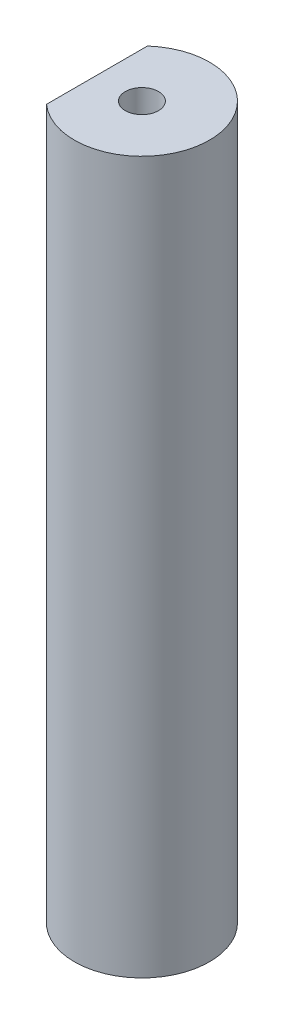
from build123d import *

# Parameters (mm, degrees)
EXTRUDE_1_DEPTH     = 60
SKETCH_2_R          = 1.4
CUT_EXTRUDE_1_DEPTH = 25
CUT_EXTRUDE_START   = -25
SKETCH_3_R          = 1.4
CUT_EXTRUDE_2_DEPTH = 25


with BuildPart() as part:
    # Sketch 1 → Extrude 1 (new body)
    with BuildSketch(Plane(origin=(0, 0, 0), x_dir=(1, 0, 0), z_dir=(0, 1, 0))):
        with BuildLine():
            Line((-3.79095569, 4.256601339), (-3.79095569, -4.256601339))
            ThreePointArc((-3.79095569, -4.256601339), (5.7, 0), (-3.79095569, 4.256601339))
        make_face()
    extrude(amount=EXTRUDE_1_DEPTH)

    # Sketch 2 → Cut-Extrude 1 (cut)
    with BuildSketch(Plane(origin=(0, 60, 0), x_dir=(1, 0, 0), z_dir=(0, 1, 0))):
        with Locations(Location((0, 0, 0), (0, 0, 270))):
            Circle(SKETCH_2_R)
    extrude(amount=-CUT_EXTRUDE_1_DEPTH, mode=Mode.SUBTRACT)

    # Sketch 3 → Cut-Extrude 2 (cut)
    with BuildSketch(Plane.XZ.offset(CUT_EXTRUDE_START)):
        with Locations(Location((0, 0, 0), (0, 0, 90))):
            Circle(SKETCH_3_R)
    extrude(amount=CUT_EXTRUDE_2_DEPTH, mode=Mode.SUBTRACT)


solid = part.part
